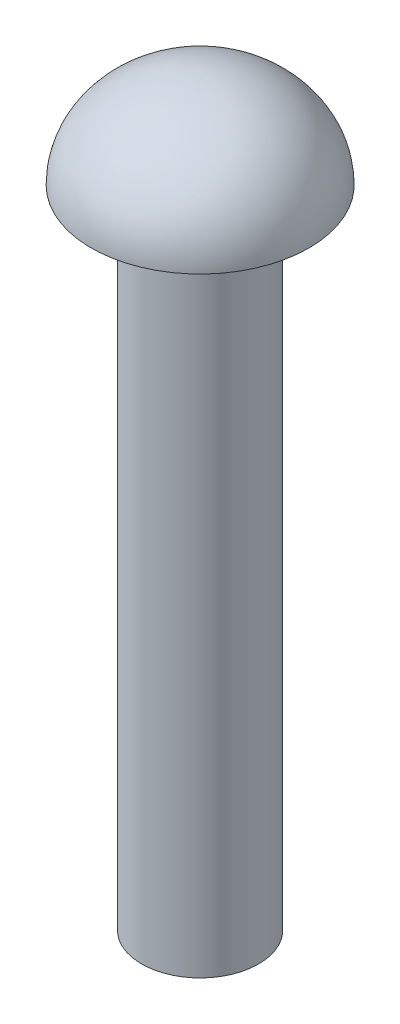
ISO-10303-21;
HEADER;
FILE_DESCRIPTION(('STEP AP214'),'2;1');
FILE_NAME('part.step','',(''),(''),'','','');
FILE_SCHEMA(('AUTOMOTIVE_DESIGN { 1 0 10303 214 1 1 1 1 }'));
ENDSEC;
DATA;
#1=APPLICATION_CONTEXT('core data for automotive mechanical design processes');
#2=APPLICATION_PROTOCOL_DEFINITION('international standard','automotive_design',2000,#1);
#3=PRODUCT_CONTEXT('',#1,'mechanical');
#4=PRODUCT('Part','Part','',(#3));
#5=PRODUCT_RELATED_PRODUCT_CATEGORY('part','',(#4));
#6=PRODUCT_DEFINITION_FORMATION('','',#4);
#7=PRODUCT_DEFINITION_CONTEXT('part definition',#1,'design');
#8=PRODUCT_DEFINITION('design','',#6,#7);
#9=PRODUCT_DEFINITION_SHAPE('','',#8);
#10=(LENGTH_UNIT() NAMED_UNIT(*) SI_UNIT(.MILLI.,.METRE.));
#11=(NAMED_UNIT(*) PLANE_ANGLE_UNIT() SI_UNIT($,.RADIAN.));
#12=(NAMED_UNIT(*) SI_UNIT($,.STERADIAN.) SOLID_ANGLE_UNIT());
#13=UNCERTAINTY_MEASURE_WITH_UNIT(LENGTH_MEASURE(1.E-05),#10,'distance_accuracy_value','');
#14=(GEOMETRIC_REPRESENTATION_CONTEXT(3) GLOBAL_UNCERTAINTY_ASSIGNED_CONTEXT((#13)) GLOBAL_UNIT_ASSIGNED_CONTEXT((#10,
#11,#12)) REPRESENTATION_CONTEXT('',''));
#15=CARTESIAN_POINT('',(0.,0.,0.));
#16=DIRECTION('',(0.,0.,1.));
#17=DIRECTION('',(1.,0.,0.));
#18=AXIS2_PLACEMENT_3D('',#15,#16,#17);
#19=CARTESIAN_POINT('',(0.,0.,0.));
#20=DIRECTION('',(0.,-1.,0.));
#21=DIRECTION('',(0.,0.,-1.));
#22=AXIS2_PLACEMENT_3D('',#19,#20,#21);
#23=PLANE('',#22);
#24=CARTESIAN_POINT('',(0.,0.,0.));
#25=DIRECTION('',(0.,-1.,0.));
#26=DIRECTION('',(0.,0.,-1.));
#27=AXIS2_PLACEMENT_3D('',#24,#25,#26);
#28=CIRCLE('',#27,2.7);
#29=CARTESIAN_POINT('',(0.,0.,-2.7));
#30=VERTEX_POINT('',#29);
#31=EDGE_CURVE('E11',#30,#30,#28,.T.);
#32=ORIENTED_EDGE('',*,*,#31,.T.);
#33=EDGE_LOOP('',(#32));
#34=FACE_BOUND('',#33,.T.);
#35=CARTESIAN_POINT('',(0.,0.,0.));
#36=DIRECTION('',(0.,-1.,0.));
#37=DIRECTION('',(0.,0.,-1.));
#38=AXIS2_PLACEMENT_3D('',#35,#36,#37);
#39=CIRCLE('',#38,1.45);
#40=CARTESIAN_POINT('',(0.,0.,-1.45));
#41=VERTEX_POINT('',#40);
#42=EDGE_CURVE('E56',#41,#41,#39,.T.);
#43=ORIENTED_EDGE('',*,*,#42,.F.);
#44=EDGE_LOOP('',(#43));
#45=FACE_BOUND('',#44,.T.);
#46=ADVANCED_FACE('F37',(#34,#45),#23,.T.);
#47=CARTESIAN_POINT('',(0.,0.,0.));
#48=DIRECTION('',(0.,0.,1.));
#49=DIRECTION('',(1.,0.,0.));
#50=AXIS2_PLACEMENT_3D('',#47,#48,#49);
#51=ELLIPSE('',#50,2.7,2.3);
#52=TRIMMED_CURVE('',#51,(PARAMETER_VALUE(-1.5707963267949)),(PARAMETER_VALUE(1.5707963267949)),
.T.,.PARAMETER.);
#53=CARTESIAN_POINT('',(0.,-11.0432199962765,0.));
#54=DIRECTION('',(0.,-1.,0.));
#55=AXIS1_PLACEMENT('',#53,#54);
#56=SURFACE_OF_REVOLUTION('',#52,#55);
#57=CARTESIAN_POINT('',(0.,2.3,0.));
#58=VERTEX_POINT('',#57);
#59=VERTEX_LOOP('',#58);
#60=FACE_BOUND('',#59,.T.);
#61=ORIENTED_EDGE('',*,*,#31,.F.);
#62=EDGE_LOOP('',(#61));
#63=FACE_BOUND('',#62,.T.);
#64=ADVANCED_FACE('F46',(#60,#63),#56,.F.);
#65=CARTESIAN_POINT('',(0.,-16.,0.));
#66=DIRECTION('',(0.,1.,0.));
#67=DIRECTION('',(0.,0.,1.));
#68=AXIS2_PLACEMENT_3D('',#65,#66,#67);
#69=CYLINDRICAL_SURFACE('',#68,1.45);
#70=CARTESIAN_POINT('',(0.,-16.,0.));
#71=DIRECTION('',(0.,-1.,0.));
#72=DIRECTION('',(0.,0.,-1.));
#73=AXIS2_PLACEMENT_3D('',#70,#71,#72);
#74=CIRCLE('',#73,1.45);
#75=CARTESIAN_POINT('',(0.,-16.,-1.45));
#76=VERTEX_POINT('',#75);
#77=EDGE_CURVE('E43',#76,#76,#74,.T.);
#78=ORIENTED_EDGE('',*,*,#77,.F.);
#79=EDGE_LOOP('',(#78));
#80=FACE_BOUND('',#79,.T.);
#81=ORIENTED_EDGE('',*,*,#42,.T.);
#82=EDGE_LOOP('',(#81));
#83=FACE_BOUND('',#82,.T.);
#84=ADVANCED_FACE('F49',(#80,#83),#69,.T.);
#85=CARTESIAN_POINT('',(0.,-16.,0.));
#86=DIRECTION('',(0.,-1.,0.));
#87=DIRECTION('',(0.,0.,-1.));
#88=AXIS2_PLACEMENT_3D('',#85,#86,#87);
#89=PLANE('',#88);
#90=ORIENTED_EDGE('',*,*,#77,.T.);
#91=EDGE_LOOP('',(#90));
#92=FACE_BOUND('',#91,.T.);
#93=ADVANCED_FACE('F65',(#92),#89,.T.);
#94=CLOSED_SHELL('',(#46,#64,#84,#93));
#95=MANIFOLD_SOLID_BREP('B2',#94);
#96=ADVANCED_BREP_SHAPE_REPRESENTATION('',(#18,#95),#14);
#97=SHAPE_DEFINITION_REPRESENTATION(#9,#96);
ENDSEC;
END-ISO-10303-21;
